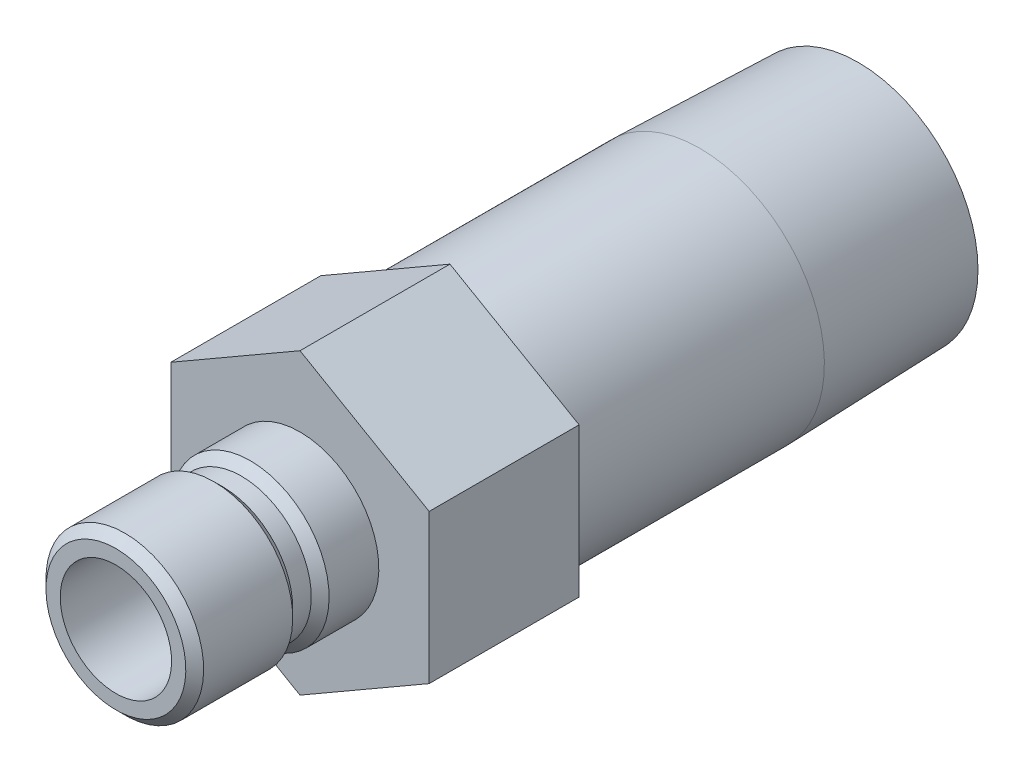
from build123d import *

# Parameters (mm, degrees)
SKETCH2_R           = 4.7625
BOSS_EXTRUDE1_DEPTH = 12.827


with BuildPart() as part:
    # Sketch1 → Revolve1 (revolve)
    with BuildSketch(Plane(origin=(0, 0, 0), x_dir=(0, 0, -1), z_dir=(1, 0, 0))):
        Polygon((-15.748, 4.7625), (-15.748, 5.9817), (-14.986, 6.7437), (-7.366, 6.7437), (-6.604, 5.9817), (-5.0165, 5.9817), (-4.2545, 6.7437), (0, 6.7437), (0, 10.668), (34.1884, 10.668), (47.752, 10.244140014), (47.752, 7.8994), (12.827, 7.8994), (12.827, 4.7625), align=None)
    revolve(axis=Axis((0, 0, 0), (0, 0, 1)))

    # Sketch2 → Boss-Extrude1 (add)
    with BuildSketch(Plane.XY):
        Polygon((-11.049, 6.379143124), (-11.049, -6.379143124), (0, -12.758286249), (11.049, -6.379143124), (11.049, 6.379143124), (0, 12.758286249), align=None)
        with Locations(Location((0, 0, 0), (0, 0, 90))):
            Circle(SKETCH2_R, mode=Mode.SUBTRACT)
    extrude(amount=-BOSS_EXTRUDE1_DEPTH)


solid = part.part
